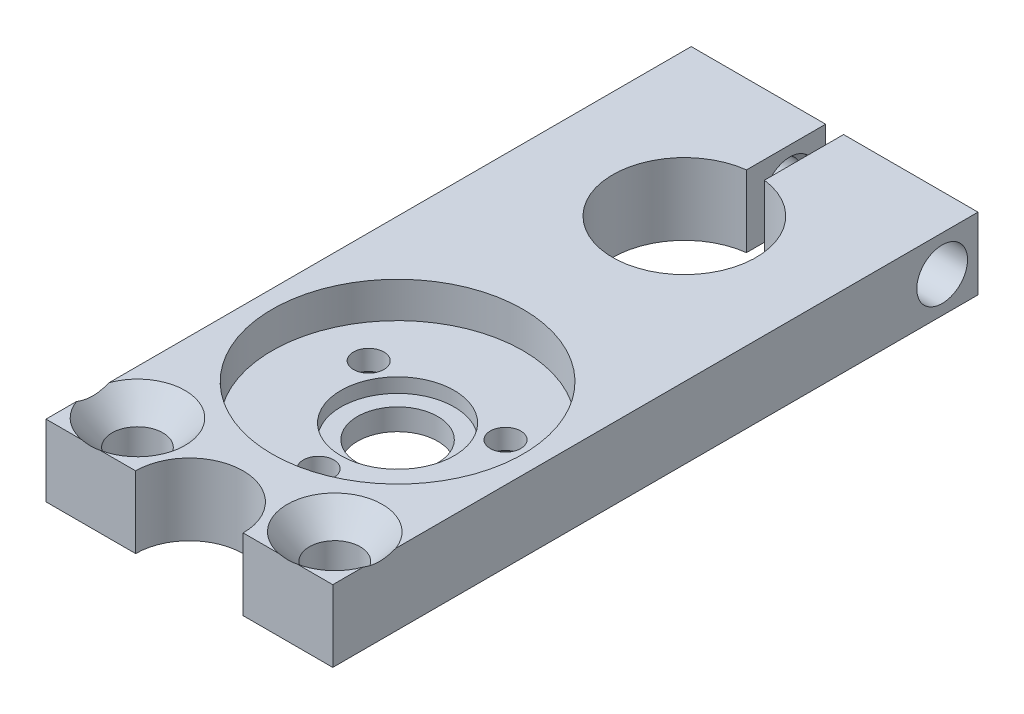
ISO-10303-21;
HEADER;
FILE_DESCRIPTION(('STEP AP214'),'2;1');
FILE_NAME('part.step','',(''),(''),'','','');
FILE_SCHEMA(('AUTOMOTIVE_DESIGN { 1 0 10303 214 1 1 1 1 }'));
ENDSEC;
DATA;
#1=APPLICATION_CONTEXT('core data for automotive mechanical design processes');
#2=APPLICATION_PROTOCOL_DEFINITION('international standard','automotive_design',2000,#1);
#3=PRODUCT_CONTEXT('',#1,'mechanical');
#4=PRODUCT('Part','Part','',(#3));
#5=PRODUCT_RELATED_PRODUCT_CATEGORY('part','',(#4));
#6=PRODUCT_DEFINITION_FORMATION('','',#4);
#7=PRODUCT_DEFINITION_CONTEXT('part definition',#1,'design');
#8=PRODUCT_DEFINITION('design','',#6,#7);
#9=PRODUCT_DEFINITION_SHAPE('','',#8);
#10=(LENGTH_UNIT() NAMED_UNIT(*) SI_UNIT(.MILLI.,.METRE.));
#11=(NAMED_UNIT(*) PLANE_ANGLE_UNIT() SI_UNIT($,.RADIAN.));
#12=(NAMED_UNIT(*) SI_UNIT($,.STERADIAN.) SOLID_ANGLE_UNIT());
#13=UNCERTAINTY_MEASURE_WITH_UNIT(LENGTH_MEASURE(1.E-05),#10,'distance_accuracy_value','');
#14=(GEOMETRIC_REPRESENTATION_CONTEXT(3) GLOBAL_UNCERTAINTY_ASSIGNED_CONTEXT((#13)) GLOBAL_UNIT_ASSIGNED_CONTEXT((#10,
#11,#12)) REPRESENTATION_CONTEXT('',''));
#15=CARTESIAN_POINT('',(0.,0.,0.));
#16=DIRECTION('',(0.,0.,1.));
#17=DIRECTION('',(1.,0.,0.));
#18=AXIS2_PLACEMENT_3D('',#15,#16,#17);
#19=CARTESIAN_POINT('',(12.7,3.17499999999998,0.));
#20=DIRECTION('',(0.,-1.,0.));
#21=DIRECTION('',(0.,0.,-1.));
#22=AXIS2_PLACEMENT_3D('',#19,#20,#21);
#23=PLANE('',#22);
#24=DIRECTION('',(-1.,0.,0.));
#25=VECTOR('',#24,1.);
#26=CARTESIAN_POINT('',(12.7,3.17499999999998,0.));
#27=LINE('',#26,#25);
#28=CARTESIAN_POINT('',(-9.53558052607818,3.17499999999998,0.));
#29=VERTEX_POINT('',#28);
#30=CARTESIAN_POINT('',(-12.7,3.17499999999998,0.));
#31=VERTEX_POINT('',#30);
#32=EDGE_CURVE('E165',#29,#31,#27,.T.);
#33=ORIENTED_EDGE('',*,*,#32,.F.);
#34=CARTESIAN_POINT('',(-8.7376,3.17499999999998,-4.1402));
#35=DIRECTION('',(0.,1.,0.));
#36=DIRECTION('',(0.,0.,1.));
#37=AXIS2_PLACEMENT_3D('',#34,#35,#36);
#38=CIRCLE('',#37,4.2164);
#39=CARTESIAN_POINT('',(-12.7,3.17499999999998,-2.69887588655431));
#40=VERTEX_POINT('',#39);
#41=EDGE_CURVE('E145',#40,#29,#38,.T.);
#42=ORIENTED_EDGE('',*,*,#41,.F.);
#43=DIRECTION('',(0.,0.,1.));
#44=VECTOR('',#43,1.);
#45=CARTESIAN_POINT('',(-12.7,3.17499999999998,0.));
#46=LINE('',#45,#44);
#47=EDGE_CURVE('E259',#40,#31,#46,.T.);
#48=ORIENTED_EDGE('',*,*,#47,.T.);
#49=EDGE_LOOP('',(#33,#42,#48));
#50=FACE_BOUND('',#49,.T.);
#51=ADVANCED_FACE('F38',(#50),#23,.F.);
#52=DIRECTION('',(0.,0.,1.));
#53=VECTOR('',#52,1.);
#54=CARTESIAN_POINT('',(12.7,3.17499999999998,0.));
#55=LINE('',#54,#53);
#56=CARTESIAN_POINT('',(12.7,3.17499999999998,-2.69887588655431));
#57=VERTEX_POINT('',#56);
#58=CARTESIAN_POINT('',(12.7,3.17499999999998,0.));
#59=VERTEX_POINT('',#58);
#60=EDGE_CURVE('E285',#57,#59,#55,.T.);
#61=ORIENTED_EDGE('',*,*,#60,.F.);
#62=CARTESIAN_POINT('',(8.7376,3.17499999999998,-4.1402));
#63=DIRECTION('',(0.,1.,0.));
#64=DIRECTION('',(0.,0.,1.));
#65=AXIS2_PLACEMENT_3D('',#62,#63,#64);
#66=CIRCLE('',#65,4.2164);
#67=CARTESIAN_POINT('',(9.53558052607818,3.17499999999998,0.));
#68=VERTEX_POINT('',#67);
#69=EDGE_CURVE('E66',#68,#57,#66,.T.);
#70=ORIENTED_EDGE('',*,*,#69,.F.);
#71=EDGE_CURVE('E167',#59,#68,#27,.T.);
#72=ORIENTED_EDGE('',*,*,#71,.F.);
#73=EDGE_LOOP('',(#61,#70,#72));
#74=FACE_BOUND('',#73,.T.);
#75=ADVANCED_FACE('F238',(#74),#23,.F.);
#76=CARTESIAN_POINT('',(-0.793750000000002,-3.17599999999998,-57.15));
#77=DIRECTION('',(-1.,0.,0.));
#78=DIRECTION('',(0.,0.,1.));
#79=AXIS2_PLACEMENT_3D('',#76,#77,#78);
#80=PLANE('',#79);
#81=CARTESIAN_POINT('',(-0.793750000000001,0.,-53.975));
#82=DIRECTION('',(-1.,0.,0.));
#83=DIRECTION('',(0.,0.,1.));
#84=AXIS2_PLACEMENT_3D('',#81,#82,#83);
#85=CIRCLE('',#84,2.24789999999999);
#86=CARTESIAN_POINT('',(-0.79375,0.,-51.7271));
#87=VERTEX_POINT('',#86);
#88=EDGE_CURVE('E212',#87,#87,#85,.T.);
#89=ORIENTED_EDGE('',*,*,#88,.T.);
#90=EDGE_LOOP('',(#89));
#91=FACE_BOUND('',#90,.T.);
#92=DIRECTION('',(0.,0.,-1.));
#93=VECTOR('',#92,1.);
#94=CARTESIAN_POINT('',(-0.793750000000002,-3.17499999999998,-57.15));
#95=LINE('',#94,#93);
#96=CARTESIAN_POINT('',(-0.793749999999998,-3.17499999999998,-50.1405953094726));
#97=VERTEX_POINT('',#96);
#98=CARTESIAN_POINT('',(-0.793750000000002,-3.17499999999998,-57.15));
#99=VERTEX_POINT('',#98);
#100=EDGE_CURVE('E328',#97,#99,#95,.T.);
#101=ORIENTED_EDGE('',*,*,#100,.T.);
#102=DIRECTION('',(0.,1.,0.));
#103=VECTOR('',#102,1.);
#104=CARTESIAN_POINT('',(-0.793750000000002,-3.17599999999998,-57.15));
#105=LINE('',#104,#103);
#106=CARTESIAN_POINT('',(-0.793750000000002,3.17500000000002,-57.15));
#107=VERTEX_POINT('',#106);
#108=EDGE_CURVE('E338',#99,#107,#105,.T.);
#109=ORIENTED_EDGE('',*,*,#108,.T.);
#110=DIRECTION('',(0.,0.,1.));
#111=VECTOR('',#110,1.);
#112=CARTESIAN_POINT('',(-0.793750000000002,3.17500000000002,-57.15));
#113=LINE('',#112,#111);
#114=CARTESIAN_POINT('',(-0.793749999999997,3.17500000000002,-50.1405953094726));
#115=VERTEX_POINT('',#114);
#116=EDGE_CURVE('E330',#107,#115,#113,.T.);
#117=ORIENTED_EDGE('',*,*,#116,.T.);
#118=DIRECTION('',(0.,1.,0.));
#119=VECTOR('',#118,1.);
#120=CARTESIAN_POINT('',(-0.793749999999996,-3.17599999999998,-50.1405953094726));
#121=LINE('',#120,#119);
#122=EDGE_CURVE('E337',#97,#115,#121,.T.);
#123=ORIENTED_EDGE('',*,*,#122,.F.);
#124=EDGE_LOOP('',(#101,#109,#117,#123));
#125=FACE_BOUND('',#124,.T.);
#126=ADVANCED_FACE('F255',(#91,#125),#80,.F.);
#127=CARTESIAN_POINT('',(12.7,3.17499999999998,0.));
#128=DIRECTION('',(0.,0.,-1.));
#129=DIRECTION('',(0.,1.,0.));
#130=AXIS2_PLACEMENT_3D('',#127,#128,#129);
#131=PLANE('',#130);
#132=CARTESIAN_POINT('',(-4.7625,3.17499999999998,0.));
#133=VERTEX_POINT('',#132);
#134=CARTESIAN_POINT('',(-7.93961947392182,3.17499999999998,0.));
#135=VERTEX_POINT('',#134);
#136=EDGE_CURVE('E156',#133,#135,#27,.T.);
#137=ORIENTED_EDGE('',*,*,#136,.T.);
#138=CARTESIAN_POINT('',(-15.8066704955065,7.74869599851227,0.));
#139=CARTESIAN_POINT('',(-15.6685968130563,7.61165201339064,0.));
#140=CARTESIAN_POINT('',(-15.5300227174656,7.47510839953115,0.));
#141=CARTESIAN_POINT('',(-15.2516721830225,7.20323484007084,0.));
#142=CARTESIAN_POINT('',(-15.1118956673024,7.06790497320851,0.));
#143=CARTESIAN_POINT('',(-14.8306494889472,6.79839533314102,0.));
#144=CARTESIAN_POINT('',(-14.6891767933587,6.66421872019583,0.));
#145=CARTESIAN_POINT('',(-14.4045924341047,6.39761888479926,0.));
#146=CARTESIAN_POINT('',(-14.2614808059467,6.26519562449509,0.));
#147=CARTESIAN_POINT('',(-13.9666768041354,5.99643528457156,0.));
#148=CARTESIAN_POINT('',(-13.8148926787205,5.86019862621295,0.));
#149=CARTESIAN_POINT('',(-13.5087565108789,5.5906436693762,0.));
#150=CARTESIAN_POINT('',(-13.3544045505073,5.45732527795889,0.));
#151=CARTESIAN_POINT('',(-13.0427054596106,5.19450644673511,0.));
#152=CARTESIAN_POINT('',(-12.885361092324,5.06500274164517,0.));
#153=CARTESIAN_POINT('',(-12.5668544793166,4.81079622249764,0.));
#154=CARTESIAN_POINT('',(-12.4056927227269,4.68609279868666,0.));
#155=CARTESIAN_POINT('',(-12.076928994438,4.44174023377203,0.));
#156=CARTESIAN_POINT('',(-11.9092773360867,4.32215749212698,0.));
#157=CARTESIAN_POINT('',(-11.5678943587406,4.09167374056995,0.));
#158=CARTESIAN_POINT('',(-11.3941594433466,3.98077799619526,0.));
#159=CARTESIAN_POINT('',(-11.0415061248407,3.77235519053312,0.));
#160=CARTESIAN_POINT('',(-10.8626721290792,3.67468692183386,0.));
#161=CARTESIAN_POINT('',(-10.496943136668,3.49603189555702,0.));
#162=CARTESIAN_POINT('',(-10.3100612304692,3.41501920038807,0.));
#163=CARTESIAN_POINT('',(-10.0294534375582,3.31285425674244,0.));
#164=CARTESIAN_POINT('',(-9.93896525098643,3.28276105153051,0.));
#165=CARTESIAN_POINT('',(-9.75606073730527,3.22827386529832,0.));
#166=CARTESIAN_POINT('',(-9.66364069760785,3.20389222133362,0.));
#167=CARTESIAN_POINT('',(-9.46472193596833,3.15876611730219,0.));
#168=CARTESIAN_POINT('',(-9.35800749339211,3.13895754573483,0.));
#169=CARTESIAN_POINT('',(-9.14323476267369,3.10857614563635,0.));
#170=CARTESIAN_POINT('',(-9.03517621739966,3.09800511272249,0.));
#171=CARTESIAN_POINT('',(-8.81864513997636,3.08663139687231,0.));
#172=CARTESIAN_POINT('',(-8.7101731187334,3.08581912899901,0.));
#173=CARTESIAN_POINT('',(-8.49360738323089,3.0939806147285,0.));
#174=CARTESIAN_POINT('',(-8.38551365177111,3.10295391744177,0.));
#175=CARTESIAN_POINT('',(-8.17468623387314,3.12970880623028,0.));
#176=CARTESIAN_POINT('',(-8.07190687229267,3.14713649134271,0.));
#177=CARTESIAN_POINT('',(-7.86800132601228,3.18989732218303,0.));
#178=CARTESIAN_POINT('',(-7.76687549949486,3.21523215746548,0.));
#179=CARTESIAN_POINT('',(-7.56651138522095,3.27294653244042,0.));
#180=CARTESIAN_POINT('',(-7.46727613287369,3.30533650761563,0.));
#181=CARTESIAN_POINT('',(-7.27101967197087,3.37618830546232,0.));
#182=CARTESIAN_POINT('',(-7.1739984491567,3.414650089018,0.));
#183=CARTESIAN_POINT('',(-6.94808737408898,3.51133742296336,0.));
#184=CARTESIAN_POINT('',(-6.82012680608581,3.5717287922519,0.));
#185=CARTESIAN_POINT('',(-6.56803474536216,3.70008038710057,0.));
#186=CARTESIAN_POINT('',(-6.44390508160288,3.76804415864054,0.));
#187=CARTESIAN_POINT('',(-6.19891594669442,3.91009152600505,0.));
#188=CARTESIAN_POINT('',(-6.0780629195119,3.98418616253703,0.));
#189=CARTESIAN_POINT('',(-5.83946276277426,4.13715210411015,0.));
#190=CARTESIAN_POINT('',(-5.7217151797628,4.21602270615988,0.));
#191=CARTESIAN_POINT('',(-5.48710698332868,4.37885626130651,0.));
#192=CARTESIAN_POINT('',(-5.37028802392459,4.46287897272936,0.));
#193=CARTESIAN_POINT('',(-5.13903224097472,4.634136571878,0.));
#194=CARTESIAN_POINT('',(-5.02459549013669,4.72137155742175,0.));
#195=CARTESIAN_POINT('',(-4.79790539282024,4.89836892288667,0.));
#196=CARTESIAN_POINT('',(-4.68564974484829,4.9881283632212,0.));
#197=CARTESIAN_POINT('',(-4.46291628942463,5.16981175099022,0.));
#198=CARTESIAN_POINT('',(-4.35243840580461,5.26173560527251,0.));
#199=CARTESIAN_POINT('',(-4.10770920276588,5.46880674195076,0.));
#200=CARTESIAN_POINT('',(-3.97385242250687,5.58441984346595,0.));
#201=CARTESIAN_POINT('',(-3.70809624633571,5.81787714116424,0.));
#202=CARTESIAN_POINT('',(-3.57619692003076,5.93572141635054,0.));
#203=CARTESIAN_POINT('',(-3.18294125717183,6.29202074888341,0.));
#204=CARTESIAN_POINT('',(-2.92406352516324,6.53321122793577,0.));
#205=CARTESIAN_POINT('',(-2.4110241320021,7.02079517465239,0.));
#206=CARTESIAN_POINT('',(-2.15686506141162,7.2671913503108,0.));
#207=CARTESIAN_POINT('',(-1.65220383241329,7.76370873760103,0.));
#208=CARTESIAN_POINT('',(-1.40170178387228,8.01383006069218,0.));
#209=CARTESIAN_POINT('',(-0.902902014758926,8.51749069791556,0.));
#210=CARTESIAN_POINT('',(-0.654611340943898,8.77103697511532,0.));
#211=CARTESIAN_POINT('',(-0.160257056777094,9.28029683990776,0.));
#212=CARTESIAN_POINT('',(0.0858065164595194,9.53601046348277,0.));
#213=CARTESIAN_POINT('',(0.576067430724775,10.0490532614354,0.));
#214=CARTESIAN_POINT('',(0.820265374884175,10.3063818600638,0.));
#215=CARTESIAN_POINT('',(1.3072137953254,10.8224055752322,0.));
#216=CARTESIAN_POINT('',(1.54996426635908,11.0811006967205,0.));
#217=CARTESIAN_POINT('',(2.21443772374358,11.7924679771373,0.));
#218=CARTESIAN_POINT('',(2.63495186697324,12.2462690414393,0.));
#219=CARTESIAN_POINT('',(3.47339459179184,13.1563318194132,0.));
#220=CARTESIAN_POINT('',(3.89132291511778,13.6125937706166,0.));
#221=CARTESIAN_POINT('',(4.72335370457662,14.5248901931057,0.));
#222=CARTESIAN_POINT('',(5.13746491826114,14.9809166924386,0.));
#223=CARTESIAN_POINT('',(5.96410240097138,15.8943103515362,0.));
#224=CARTESIAN_POINT('',(6.37662884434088,16.3516773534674,0.));
#225=CARTESIAN_POINT('',(6.78859656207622,16.8095442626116,0.));
#226=B_SPLINE_CURVE_WITH_KNOTS('',3,(#138,#139,#140,#141,#142,#143,#144,#145,#146,#147,#148,
#149,#150,#151,#152,#153,#154,#155,#156,#157,#158,#159,#160,#161,#162,#163,#164,#165,#166,#167,
#168,#169,#170,#171,#172,#173,#174,#175,#176,#177,#178,#179,#180,#181,#182,#183,#184,#185,#186,
#187,#188,#189,#190,#191,#192,#193,#194,#195,#196,#197,#198,#199,#200,#201,#202,#203,#204,#205,
#206,#207,#208,#209,#210,#211,#212,#213,#214,#215,#216,#217,#218,#219,#220,#221,#222,#223,#224,
#225),.UNSPECIFIED.,.F.,.F.,(4,2,2,2,2,2,2,2,2,2,2,2,2,2,2,2,2,2,2,2,2,2,2,2,2,2,2,2,2,2,2,2,2,
2,2,2,2,2,2,2,2,2,2,4),(0.,0.583619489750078,1.16727657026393,1.75220934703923,2.33712947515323,
2.94897355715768,3.56079812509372,4.17208279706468,4.7832895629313,5.40088058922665,
6.01884311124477,6.62957694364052,7.239352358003,7.52527834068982,7.81181634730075,
8.13705137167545,8.46234960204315,8.78732830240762,9.1122920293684,9.42469398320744,
9.7371627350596,10.0500968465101,10.363028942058,10.7871832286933,11.2115369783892,
11.6366722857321,12.0617451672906,12.4933707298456,12.9250094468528,13.3561648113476,
13.7873016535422,14.3178884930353,14.8484941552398,15.9098487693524,16.9717697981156,
18.033722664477,19.0983212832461,20.1629376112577,21.2271938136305,22.2914538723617,
24.1474841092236,26.0036968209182,27.8516740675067,29.6994418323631),.UNSPECIFIED.);
#227=EDGE_CURVE('E142',#135,#29,#226,.F.);
#228=ORIENTED_EDGE('',*,*,#227,.T.);
#229=ORIENTED_EDGE('',*,*,#32,.T.);
#230=DIRECTION('',(0.,-1.,0.));
#231=VECTOR('',#230,1.);
#232=CARTESIAN_POINT('',(-12.7,3.17499999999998,0.));
#233=LINE('',#232,#231);
#234=CARTESIAN_POINT('',(-12.7,-3.17499999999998,0.));
#235=VERTEX_POINT('',#234);
#236=EDGE_CURVE('E262',#31,#235,#233,.T.);
#237=ORIENTED_EDGE('',*,*,#236,.T.);
#238=DIRECTION('',(-1.,0.,0.));
#239=VECTOR('',#238,1.);
#240=CARTESIAN_POINT('',(12.7,-3.17499999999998,0.));
#241=LINE('',#240,#239);
#242=CARTESIAN_POINT('',(-4.7625,-3.17499999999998,0.));
#243=VERTEX_POINT('',#242);
#244=EDGE_CURVE('E187',#243,#235,#241,.T.);
#245=ORIENTED_EDGE('',*,*,#244,.F.);
#246=DIRECTION('',(0.,1.,0.));
#247=VECTOR('',#246,1.);
#248=CARTESIAN_POINT('',(-4.7625,-3.17600000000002,0.));
#249=LINE('',#248,#247);
#250=EDGE_CURVE('E163',#133,#243,#249,.F.);
#251=ORIENTED_EDGE('',*,*,#250,.F.);
#252=EDGE_LOOP('',(#137,#228,#229,#237,#245,#251));
#253=FACE_BOUND('',#252,.T.);
#254=ADVANCED_FACE('F161',(#253),#131,.F.);
#255=CARTESIAN_POINT('',(12.7,3.17500000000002,-57.15));
#256=DIRECTION('',(0.,0.,1.));
#257=DIRECTION('',(1.,0.,0.));
#258=AXIS2_PLACEMENT_3D('',#255,#256,#257);
#259=PLANE('',#258);
#260=DIRECTION('',(-1.,0.,0.));
#261=VECTOR('',#260,1.);
#262=CARTESIAN_POINT('',(12.7,3.17500000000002,-57.15));
#263=LINE('',#262,#261);
#264=CARTESIAN_POINT('',(-12.7,3.17500000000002,-57.15));
#265=VERTEX_POINT('',#264);
#266=EDGE_CURVE('E172',#107,#265,#263,.T.);
#267=ORIENTED_EDGE('',*,*,#266,.F.);
#268=ORIENTED_EDGE('',*,*,#108,.F.);
#269=DIRECTION('',(-1.,0.,0.));
#270=VECTOR('',#269,1.);
#271=CARTESIAN_POINT('',(12.7,-3.17499999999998,-57.15));
#272=LINE('',#271,#270);
#273=CARTESIAN_POINT('',(-12.7,-3.17499999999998,-57.15));
#274=VERTEX_POINT('',#273);
#275=EDGE_CURVE('E182',#99,#274,#272,.T.);
#276=ORIENTED_EDGE('',*,*,#275,.T.);
#277=DIRECTION('',(0.,1.,0.));
#278=VECTOR('',#277,1.);
#279=CARTESIAN_POINT('',(-12.7,3.17500000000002,-57.15));
#280=LINE('',#279,#278);
#281=EDGE_CURVE('E269',#274,#265,#280,.T.);
#282=ORIENTED_EDGE('',*,*,#281,.T.);
#283=EDGE_LOOP('',(#267,#268,#276,#282));
#284=FACE_BOUND('',#283,.T.);
#285=ADVANCED_FACE('F242',(#284),#259,.F.);
#286=ORIENTED_EDGE('',*,*,#71,.T.);
#287=CARTESIAN_POINT('',(1.60909571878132,7.80775586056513,0.));
#288=CARTESIAN_POINT('',(1.74865218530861,7.66894548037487,0.));
#289=CARTESIAN_POINT('',(1.88871022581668,7.53063558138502,0.));
#290=CARTESIAN_POINT('',(2.17003284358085,7.25523087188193,0.));
#291=CARTESIAN_POINT('',(2.31129749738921,7.11813613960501,0.));
#292=CARTESIAN_POINT('',(2.59552946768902,6.84509539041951,0.));
#293=CARTESIAN_POINT('',(2.73849983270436,6.70915254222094,0.));
#294=CARTESIAN_POINT('',(3.02608837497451,6.43902509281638,0.));
#295=CARTESIAN_POINT('',(3.17070651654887,6.30484045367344,0.));
#296=CARTESIAN_POINT('',(3.46866459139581,6.03243088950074,0.));
#297=CARTESIAN_POINT('',(3.62209770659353,5.89430766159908,0.));
#298=CARTESIAN_POINT('',(3.93155467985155,5.62099654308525,0.));
#299=CARTESIAN_POINT('',(4.08757845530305,5.48580855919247,0.));
#300=CARTESIAN_POINT('',(4.4026524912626,5.21928002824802,0.));
#301=CARTESIAN_POINT('',(4.56169994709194,5.0879361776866,0.));
#302=CARTESIAN_POINT('',(4.88366130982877,4.83009389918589,0.));
#303=CARTESIAN_POINT('',(5.04657471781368,4.70359485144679,0.));
#304=CARTESIAN_POINT('',(5.37813439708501,4.45630136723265,0.));
#305=CARTESIAN_POINT('',(5.54680774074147,4.3355429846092,0.));
#306=CARTESIAN_POINT('',(5.89028016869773,4.10273583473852,0.));
#307=CARTESIAN_POINT('',(6.06508292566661,3.99069242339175,0.));
#308=CARTESIAN_POINT('',(6.41991759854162,3.78005750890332,0.));
#309=CARTESIAN_POINT('',(6.5998638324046,3.68132329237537,0.));
#310=CARTESIAN_POINT('',(6.96791726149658,3.50066148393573,0.));
#311=CARTESIAN_POINT('',(7.15601106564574,3.41870749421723,0.));
#312=CARTESIAN_POINT('',(7.43751068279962,3.3156944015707,0.));
#313=CARTESIAN_POINT('',(7.52760858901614,3.28554625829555,0.));
#314=CARTESIAN_POINT('',(7.70972572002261,3.23088259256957,0.));
#315=CARTESIAN_POINT('',(7.80174866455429,3.20637933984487,0.));
#316=CARTESIAN_POINT('',(8.00025776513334,3.16081609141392,0.));
#317=CARTESIAN_POINT('',(8.106967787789,3.14071598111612,0.));
#318=CARTESIAN_POINT('',(8.32175533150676,3.1097367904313,0.));
#319=CARTESIAN_POINT('',(8.42983311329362,3.09885949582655,0.));
#320=CARTESIAN_POINT('',(8.64642731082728,3.08687323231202,0.));
#321=CARTESIAN_POINT('',(8.75494317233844,3.08575439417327,0.));
#322=CARTESIAN_POINT('',(8.97162345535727,3.09331750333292,0.));
#323=CARTESIAN_POINT('',(9.07978789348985,3.10199898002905,0.));
#324=CARTESIAN_POINT('',(9.29081912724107,3.12821439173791,0.));
#325=CARTESIAN_POINT('',(9.39373030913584,3.14539702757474,0.));
#326=CARTESIAN_POINT('',(9.59791105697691,3.18770697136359,0.));
#327=CARTESIAN_POINT('',(9.69918026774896,3.21283597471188,0.));
#328=CARTESIAN_POINT('',(9.89983748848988,3.27017914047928,0.));
#329=CARTESIAN_POINT('',(9.99922243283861,3.30240392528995,0.));
#330=CARTESIAN_POINT('',(10.1957772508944,3.37296323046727,0.));
#331=CARTESIAN_POINT('',(10.292947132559,3.41129772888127,0.));
#332=CARTESIAN_POINT('',(10.5182523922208,3.50731950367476,0.));
#333=CARTESIAN_POINT('',(10.6454860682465,3.56711695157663,0.));
#334=CARTESIAN_POINT('',(10.8961648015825,3.69423120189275,0.));
#335=CARTESIAN_POINT('',(11.0196080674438,3.76155149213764,0.));
#336=CARTESIAN_POINT('',(11.2632523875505,3.90227904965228,0.));
#337=CARTESIAN_POINT('',(11.3834471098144,3.97569720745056,0.));
#338=CARTESIAN_POINT('',(11.6207541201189,4.12729166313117,0.));
#339=CARTESIAN_POINT('',(11.7378668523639,4.20546726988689,0.));
#340=CARTESIAN_POINT('',(11.9712133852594,4.36688943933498,0.));
#341=CARTESIAN_POINT('',(12.0874057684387,4.45019561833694,0.));
#342=CARTESIAN_POINT('',(12.3174206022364,4.6200134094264,0.));
#343=CARTESIAN_POINT('',(12.4312429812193,4.7065251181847,0.));
#344=CARTESIAN_POINT('',(12.6567148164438,4.88207391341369,0.));
#345=CARTESIAN_POINT('',(12.7683665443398,4.97110809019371,0.));
#346=CARTESIAN_POINT('',(12.9898981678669,5.15133916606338,0.));
#347=CARTESIAN_POINT('',(13.0997781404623,5.24253597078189,0.));
#348=CARTESIAN_POINT('',(13.3441409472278,5.44879705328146,0.));
#349=CARTESIAN_POINT('',(13.4782136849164,5.56434670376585,0.));
#350=CARTESIAN_POINT('',(13.7443801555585,5.79770621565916,0.));
#351=CARTESIAN_POINT('',(13.87647381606,5.91551615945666,0.));
#352=CARTESIAN_POINT('',(14.2702873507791,6.27174652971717,0.));
#353=CARTESIAN_POINT('',(14.5295024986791,6.5129356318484,0.));
#354=CARTESIAN_POINT('',(15.0431735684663,7.00057383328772,0.));
#355=CARTESIAN_POINT('',(15.2976268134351,7.24702573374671,0.));
#356=CARTESIAN_POINT('',(15.8028444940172,7.74369021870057,0.));
#357=CARTESIAN_POINT('',(16.0536088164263,7.9939029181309,0.));
#358=CARTESIAN_POINT('',(16.5529210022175,8.49778046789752,0.));
#359=CARTESIAN_POINT('',(16.8014616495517,8.75145245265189,0.));
#360=CARTESIAN_POINT('',(17.2962994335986,9.26098086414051,0.));
#361=CARTESIAN_POINT('',(17.5425965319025,9.51683732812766,0.));
#362=CARTESIAN_POINT('',(18.0333102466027,10.0301759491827,0.));
#363=CARTESIAN_POINT('',(18.2777274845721,10.2876575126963,0.));
#364=CARTESIAN_POINT('',(18.765105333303,10.8039961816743,0.));
#365=CARTESIAN_POINT('',(19.0080659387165,11.0628532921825,0.));
#366=CARTESIAN_POINT('',(19.6725550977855,11.7740842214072,0.));
#367=CARTESIAN_POINT('',(20.0928724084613,12.227589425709,0.));
#368=CARTESIAN_POINT('',(20.9309145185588,13.1370691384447,0.));
#369=CARTESIAN_POINT('',(21.3486390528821,13.5930438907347,0.));
#370=CARTESIAN_POINT('',(22.180227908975,14.5047398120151,0.));
#371=CARTESIAN_POINT('',(22.5941011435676,14.9604528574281,0.));
#372=CARTESIAN_POINT('',(23.4202578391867,15.8732221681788,0.));
#373=CARTESIAN_POINT('',(23.8325414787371,16.3302782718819,0.));
#374=CARTESIAN_POINT('',(24.2442651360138,16.7878354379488,0.));
#375=B_SPLINE_CURVE_WITH_KNOTS('',3,(#287,#288,#289,#290,#291,#292,#293,#294,#295,#296,#297,
#298,#299,#300,#301,#302,#303,#304,#305,#306,#307,#308,#309,#310,#311,#312,#313,#314,#315,#316,
#317,#318,#319,#320,#321,#322,#323,#324,#325,#326,#327,#328,#329,#330,#331,#332,#333,#334,#335,
#336,#337,#338,#339,#340,#341,#342,#343,#344,#345,#346,#347,#348,#349,#350,#351,#352,#353,#354,
#355,#356,#357,#358,#359,#360,#361,#362,#363,#364,#365,#366,#367,#368,#369,#370,#371,#372,#373,
#374),.UNSPECIFIED.,.F.,.F.,(4,2,2,2,2,2,2,2,2,2,2,2,2,2,2,2,2,2,2,2,2,2,2,2,2,2,2,2,2,2,2,2,2,
2,2,2,2,2,2,2,2,2,2,4),(0.,0.590510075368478,1.1810578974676,1.77289750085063,2.36472431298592,
2.98403103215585,3.60331804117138,4.22205622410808,4.8407149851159,5.46285048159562,
6.08536534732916,6.70055861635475,7.31477652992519,7.59964692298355,7.88513078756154,
8.21051491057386,8.53596202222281,8.86107995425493,9.18618227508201,9.49884973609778,
9.81158395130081,10.1247895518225,10.4379940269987,10.8594200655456,11.2810423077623,
11.7034344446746,12.1257653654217,12.5546102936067,12.983468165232,13.411850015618,
13.8402132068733,14.3711653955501,14.9021369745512,15.964227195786,17.0268975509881,
18.0896004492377,19.154992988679,20.2204037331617,21.2854455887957,22.3504913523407,
24.2054690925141,26.0606334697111,27.9074345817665,29.7540218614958),.UNSPECIFIED.);
#376=CARTESIAN_POINT('',(7.93961947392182,3.17499999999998,0.));
#377=VERTEX_POINT('',#376);
#378=EDGE_CURVE('E298',#68,#377,#375,.F.);
#379=ORIENTED_EDGE('',*,*,#378,.T.);
#380=CARTESIAN_POINT('',(4.7625,3.17499999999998,0.));
#381=VERTEX_POINT('',#380);
#382=EDGE_CURVE('E164',#377,#381,#27,.T.);
#383=ORIENTED_EDGE('',*,*,#382,.T.);
#384=DIRECTION('',(0.,1.,0.));
#385=VECTOR('',#384,1.);
#386=CARTESIAN_POINT('',(4.7625,-3.17600000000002,0.));
#387=LINE('',#386,#385);
#388=CARTESIAN_POINT('',(4.7625,-3.17499999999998,0.));
#389=VERTEX_POINT('',#388);
#390=EDGE_CURVE('E317',#389,#381,#387,.T.);
#391=ORIENTED_EDGE('',*,*,#390,.F.);
#392=CARTESIAN_POINT('',(12.7,-3.17499999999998,0.));
#393=VERTEX_POINT('',#392);
#394=EDGE_CURVE('E188',#393,#389,#241,.T.);
#395=ORIENTED_EDGE('',*,*,#394,.F.);
#396=DIRECTION('',(0.,-1.,0.));
#397=VECTOR('',#396,1.);
#398=CARTESIAN_POINT('',(12.7,3.17499999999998,0.));
#399=LINE('',#398,#397);
#400=EDGE_CURVE('E277',#59,#393,#399,.T.);
#401=ORIENTED_EDGE('',*,*,#400,.F.);
#402=EDGE_LOOP('',(#286,#379,#383,#391,#395,#401));
#403=FACE_BOUND('',#402,.T.);
#404=ADVANCED_FACE('F40',(#403),#131,.F.);
#405=CARTESIAN_POINT('',(12.7,-3.17499999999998,0.));
#406=DIRECTION('',(0.,1.,0.));
#407=DIRECTION('',(0.,0.,1.));
#408=AXIS2_PLACEMENT_3D('',#405,#406,#407);
#409=PLANE('',#408);
#410=CARTESIAN_POINT('',(-8.7376,-3.17500000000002,-4.1402));
#411=DIRECTION('',(0.,1.,0.));
#412=DIRECTION('',(0.,0.,1.));
#413=AXIS2_PLACEMENT_3D('',#410,#411,#412);
#414=CIRCLE('',#413,2.2479);
#415=CARTESIAN_POINT('',(-8.7376,-3.17500000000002,-1.8923));
#416=VERTEX_POINT('',#415);
#417=EDGE_CURVE('E704',#416,#416,#414,.T.);
#418=ORIENTED_EDGE('',*,*,#417,.T.);
#419=EDGE_LOOP('',(#418));
#420=FACE_BOUND('',#419,.T.);
#421=CARTESIAN_POINT('',(8.7376,-3.17500000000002,-4.1402));
#422=DIRECTION('',(0.,1.,0.));
#423=DIRECTION('',(0.,0.,1.));
#424=AXIS2_PLACEMENT_3D('',#421,#422,#423);
#425=CIRCLE('',#424,2.2479);
#426=CARTESIAN_POINT('',(8.7376,-3.17500000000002,-1.8923));
#427=VERTEX_POINT('',#426);
#428=EDGE_CURVE('E149',#427,#427,#425,.T.);
#429=ORIENTED_EDGE('',*,*,#428,.T.);
#430=EDGE_LOOP('',(#429));
#431=FACE_BOUND('',#430,.T.);
#432=ORIENTED_EDGE('',*,*,#394,.T.);
#433=CARTESIAN_POINT('',(0.,-3.17499999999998,0.));
#434=DIRECTION('',(0.,1.,0.));
#435=DIRECTION('',(0.,0.,1.));
#436=AXIS2_PLACEMENT_3D('',#433,#434,#435);
#437=CIRCLE('',#436,4.7625);
#438=EDGE_CURVE('E323',#243,#389,#437,.F.);
#439=ORIENTED_EDGE('',*,*,#438,.F.);
#440=ORIENTED_EDGE('',*,*,#244,.T.);
#441=DIRECTION('',(0.,0.,-1.));
#442=VECTOR('',#441,1.);
#443=CARTESIAN_POINT('',(-12.7,-3.17499999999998,0.));
#444=LINE('',#443,#442);
#445=EDGE_CURVE('E265',#235,#274,#444,.T.);
#446=ORIENTED_EDGE('',*,*,#445,.T.);
#447=ORIENTED_EDGE('',*,*,#275,.F.);
#448=ORIENTED_EDGE('',*,*,#100,.F.);
#449=CARTESIAN_POINT('',(0.,-3.17499999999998,-43.8404));
#450=DIRECTION('',(0.,1.,0.));
#451=DIRECTION('',(0.,0.,1.));
#452=AXIS2_PLACEMENT_3D('',#449,#450,#451);
#453=CIRCLE('',#452,6.35);
#454=CARTESIAN_POINT('',(0.793749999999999,-3.17499999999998,-50.1405953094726));
#455=VERTEX_POINT('',#454);
#456=EDGE_CURVE('E340',#455,#97,#453,.F.);
#457=ORIENTED_EDGE('',*,*,#456,.F.);
#458=DIRECTION('',(0.,0.,1.));
#459=VECTOR('',#458,1.);
#460=CARTESIAN_POINT('',(0.793749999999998,-3.17499999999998,-57.15));
#461=LINE('',#460,#459);
#462=CARTESIAN_POINT('',(0.793749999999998,-3.17499999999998,-57.15));
#463=VERTEX_POINT('',#462);
#464=EDGE_CURVE('E325',#463,#455,#461,.T.);
#465=ORIENTED_EDGE('',*,*,#464,.F.);
#466=CARTESIAN_POINT('',(12.7,-3.17499999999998,-57.15));
#467=VERTEX_POINT('',#466);
#468=EDGE_CURVE('E184',#467,#463,#272,.T.);
#469=ORIENTED_EDGE('',*,*,#468,.F.);
#470=DIRECTION('',(0.,0.,-1.));
#471=VECTOR('',#470,1.);
#472=CARTESIAN_POINT('',(12.7,-3.17499999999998,0.));
#473=LINE('',#472,#471);
#474=EDGE_CURVE('E279',#393,#467,#473,.T.);
#475=ORIENTED_EDGE('',*,*,#474,.F.);
#476=EDGE_LOOP('',(#432,#439,#440,#446,#447,#448,#457,#465,#469,#475));
#477=FACE_BOUND('',#476,.T.);
#478=CARTESIAN_POINT('',(6.06018596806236,-3.17499999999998,-21.93925));
#479=DIRECTION('',(0.,-1.,0.));
#480=DIRECTION('',(0.,0.,-1.));
#481=AXIS2_PLACEMENT_3D('',#478,#479,#480);
#482=CIRCLE('',#481,2.75);
#483=CARTESIAN_POINT('',(6.06018596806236,-3.17499999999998,-24.68925));
#484=VERTEX_POINT('',#483);
#485=EDGE_CURVE('E205',#484,#484,#482,.T.);
#486=ORIENTED_EDGE('',*,*,#485,.F.);
#487=EDGE_LOOP('',(#486));
#488=FACE_BOUND('',#487,.T.);
#489=CARTESIAN_POINT('',(-6.0601859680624,-3.17499999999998,-21.9392499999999));
#490=DIRECTION('',(0.,-1.,0.));
#491=DIRECTION('',(0.,0.,-1.));
#492=AXIS2_PLACEMENT_3D('',#489,#490,#491);
#493=CIRCLE('',#492,2.75);
#494=CARTESIAN_POINT('',(-6.0601859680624,-3.17499999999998,-24.6892499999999));
#495=VERTEX_POINT('',#494);
#496=EDGE_CURVE('E200',#495,#495,#493,.T.);
#497=ORIENTED_EDGE('',*,*,#496,.F.);
#498=EDGE_LOOP('',(#497));
#499=FACE_BOUND('',#498,.T.);
#500=CARTESIAN_POINT('',(0.,-3.17499999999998,-11.4427));
#501=DIRECTION('',(0.,-1.,0.));
#502=DIRECTION('',(0.,0.,-1.));
#503=AXIS2_PLACEMENT_3D('',#500,#501,#502);
#504=CIRCLE('',#503,2.75);
#505=CARTESIAN_POINT('',(0.,-3.17499999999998,-14.1927));
#506=VERTEX_POINT('',#505);
#507=EDGE_CURVE('E195',#506,#506,#504,.T.);
#508=ORIENTED_EDGE('',*,*,#507,.F.);
#509=EDGE_LOOP('',(#508));
#510=FACE_BOUND('',#509,.T.);
#511=CARTESIAN_POINT('',(0.,-3.17499999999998,-18.4404));
#512=DIRECTION('',(0.,1.,0.));
#513=DIRECTION('',(0.,0.,1.));
#514=AXIS2_PLACEMENT_3D('',#511,#512,#513);
#515=CIRCLE('',#514,3.556);
#516=CARTESIAN_POINT('',(0.,-3.17499999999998,-14.8844));
#517=VERTEX_POINT('',#516);
#518=EDGE_CURVE('E365',#517,#517,#515,.F.);
#519=ORIENTED_EDGE('',*,*,#518,.F.);
#520=EDGE_LOOP('',(#519));
#521=FACE_BOUND('',#520,.T.);
#522=ADVANCED_FACE('F240',(#420,#431,#477,#488,#499,#510,#521),#409,.F.);
#523=ORIENTED_EDGE('',*,*,#468,.T.);
#524=DIRECTION('',(0.,1.,0.));
#525=VECTOR('',#524,1.);
#526=CARTESIAN_POINT('',(0.793749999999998,-3.17599999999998,-57.15));
#527=LINE('',#526,#525);
#528=CARTESIAN_POINT('',(0.793749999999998,3.17500000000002,-57.15));
#529=VERTEX_POINT('',#528);
#530=EDGE_CURVE('E341',#463,#529,#527,.T.);
#531=ORIENTED_EDGE('',*,*,#530,.T.);
#532=CARTESIAN_POINT('',(12.7,3.17500000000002,-57.15));
#533=VERTEX_POINT('',#532);
#534=EDGE_CURVE('E177',#533,#529,#263,.T.);
#535=ORIENTED_EDGE('',*,*,#534,.F.);
#536=DIRECTION('',(0.,1.,0.));
#537=VECTOR('',#536,1.);
#538=CARTESIAN_POINT('',(12.7,3.17500000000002,-57.15));
#539=LINE('',#538,#537);
#540=EDGE_CURVE('E282',#467,#533,#539,.T.);
#541=ORIENTED_EDGE('',*,*,#540,.F.);
#542=EDGE_LOOP('',(#523,#531,#535,#541));
#543=FACE_BOUND('',#542,.T.);
#544=ADVANCED_FACE('F236',(#543),#259,.F.);
#545=CARTESIAN_POINT('',(0.,3.17499999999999,-18.4404));
#546=DIRECTION('',(0.,1.,0.));
#547=DIRECTION('',(0.,0.,1.));
#548=AXIS2_PLACEMENT_3D('',#545,#546,#547);
#549=CIRCLE('',#548,11.1125);
#550=CARTESIAN_POINT('',(0.,3.17499999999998,-7.3279));
#551=VERTEX_POINT('',#550);
#552=EDGE_CURVE('E272',#551,#551,#549,.T.);
#553=ORIENTED_EDGE('',*,*,#552,.F.);
#554=EDGE_LOOP('',(#553));
#555=FACE_BOUND('',#554,.T.);
#556=CARTESIAN_POINT('',(-12.7,3.17499999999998,-5.58152411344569));
#557=VERTEX_POINT('',#556);
#558=EDGE_CURVE('E158',#265,#557,#46,.T.);
#559=ORIENTED_EDGE('',*,*,#558,.T.);
#560=EDGE_CURVE('E59',#135,#557,#38,.T.);
#561=ORIENTED_EDGE('',*,*,#560,.F.);
#562=ORIENTED_EDGE('',*,*,#136,.F.);
#563=CARTESIAN_POINT('',(0.,3.17499999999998,0.));
#564=DIRECTION('',(0.,1.,0.));
#565=DIRECTION('',(0.,0.,1.));
#566=AXIS2_PLACEMENT_3D('',#563,#564,#565);
#567=CIRCLE('',#566,4.7625);
#568=EDGE_CURVE('E321',#381,#133,#567,.T.);
#569=ORIENTED_EDGE('',*,*,#568,.F.);
#570=ORIENTED_EDGE('',*,*,#382,.F.);
#571=CARTESIAN_POINT('',(12.7,3.17499999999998,-5.58152411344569));
#572=VERTEX_POINT('',#571);
#573=EDGE_CURVE('E295',#572,#377,#66,.T.);
#574=ORIENTED_EDGE('',*,*,#573,.F.);
#575=EDGE_CURVE('E168',#533,#572,#55,.T.);
#576=ORIENTED_EDGE('',*,*,#575,.F.);
#577=ORIENTED_EDGE('',*,*,#534,.T.);
#578=DIRECTION('',(0.,0.,-1.));
#579=VECTOR('',#578,1.);
#580=CARTESIAN_POINT('',(0.793749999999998,3.17500000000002,-57.15));
#581=LINE('',#580,#579);
#582=CARTESIAN_POINT('',(0.793749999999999,3.17500000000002,-50.1405953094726));
#583=VERTEX_POINT('',#582);
#584=EDGE_CURVE('E335',#583,#529,#581,.T.);
#585=ORIENTED_EDGE('',*,*,#584,.F.);
#586=CARTESIAN_POINT('',(0.,3.17500000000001,-43.8404));
#587=DIRECTION('',(0.,1.,0.));
#588=DIRECTION('',(0.,0.,1.));
#589=AXIS2_PLACEMENT_3D('',#586,#587,#588);
#590=CIRCLE('',#589,6.35);
#591=EDGE_CURVE('E332',#115,#583,#590,.T.);
#592=ORIENTED_EDGE('',*,*,#591,.F.);
#593=ORIENTED_EDGE('',*,*,#116,.F.);
#594=ORIENTED_EDGE('',*,*,#266,.T.);
#595=EDGE_LOOP('',(#559,#561,#562,#569,#570,#574,#576,#577,#585,#592,#593,#594));
#596=FACE_BOUND('',#595,.T.);
#597=ADVANCED_FACE('F154',(#555,#596),#23,.F.);
#598=CARTESIAN_POINT('',(12.7,-3.17499999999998,0.));
#599=DIRECTION('',(1.,0.,0.));
#600=DIRECTION('',(0.,0.,-1.));
#601=AXIS2_PLACEMENT_3D('',#598,#599,#600);
#602=PLANE('',#601);
#603=CARTESIAN_POINT('',(12.7,8.38807789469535,-11.9394262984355));
#604=CARTESIAN_POINT('',(12.7,8.22502496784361,-11.7804257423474));
#605=CARTESIAN_POINT('',(12.7,8.06245244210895,-11.6209290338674));
#606=CARTESIAN_POINT('',(12.7,7.73849242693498,-11.3007187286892));
#607=CARTESIAN_POINT('',(12.7,7.57710500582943,-11.1400050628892));
#608=CARTESIAN_POINT('',(12.7,7.25539900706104,-10.8167935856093));
#609=CARTESIAN_POINT('',(12.7,7.09508362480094,-10.6542925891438));
#610=CARTESIAN_POINT('',(12.7,6.77621407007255,-10.3275765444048));
#611=CARTESIAN_POINT('',(12.7,6.61765985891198,-10.1633615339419));
#612=CARTESIAN_POINT('',(12.7,6.29426184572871,-9.82396375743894));
#613=CARTESIAN_POINT('',(12.7,6.12953836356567,-9.6486660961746));
#614=CARTESIAN_POINT('',(12.7,5.80318888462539,-9.29521274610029));
#615=CARTESIAN_POINT('',(12.7,5.64156279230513,-9.11705714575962));
#616=CARTESIAN_POINT('',(12.7,5.32250553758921,-8.75732114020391));
#617=CARTESIAN_POINT('',(12.7,5.16507049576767,-8.57574418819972));
#618=CARTESIAN_POINT('',(12.7,4.85562307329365,-8.20804357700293));
#619=CARTESIAN_POINT('',(12.7,4.7036099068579,-8.02192058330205));
#620=CARTESIAN_POINT('',(12.7,4.41773655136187,-7.65742017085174));
#621=CARTESIAN_POINT('',(12.7,4.28335778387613,-7.47945196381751));
#622=CARTESIAN_POINT('',(12.7,4.02341376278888,-7.11690856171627));
#623=CARTESIAN_POINT('',(12.7,3.89785526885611,-6.93232845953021));
#624=CARTESIAN_POINT('',(12.7,3.66103487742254,-6.55744633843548));
#625=CARTESIAN_POINT('',(12.7,3.54960966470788,-6.36724864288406));
#626=CARTESIAN_POINT('',(12.7,3.34498049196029,-5.97738963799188));
#627=CARTESIAN_POINT('',(12.7,3.25174273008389,-5.77774675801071));
#628=CARTESIAN_POINT('',(12.7,3.141405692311,-5.49566056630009));
#629=CARTESIAN_POINT('',(12.7,3.11303256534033,-5.41759753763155));
#630=CARTESIAN_POINT('',(12.7,3.06049177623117,-5.25985852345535));
#631=CARTESIAN_POINT('',(12.7,3.0363339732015,-5.18017923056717));
#632=CARTESIAN_POINT('',(12.7,2.9872378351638,-4.99885210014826));
#633=CARTESIAN_POINT('',(12.7,2.96369391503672,-4.89682012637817));
#634=CARTESIAN_POINT('',(12.7,2.92517216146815,-4.69111328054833));
#635=CARTESIAN_POINT('',(12.7,2.91019599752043,-4.58743809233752));
#636=CARTESIAN_POINT('',(12.7,2.88954223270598,-4.37929588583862));
#637=CARTESIAN_POINT('',(12.7,2.88385187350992,-4.27483015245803));
#638=CARTESIAN_POINT('',(12.7,2.88202446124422,-4.06582196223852));
#639=CARTESIAN_POINT('',(12.7,2.88588662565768,-3.96127951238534));
#640=CARTESIAN_POINT('',(12.7,2.90272398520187,-3.75585571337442));
#641=CARTESIAN_POINT('',(12.7,2.91544414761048,-3.65495308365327));
#642=CARTESIAN_POINT('',(12.7,2.94914196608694,-3.45453243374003));
#643=CARTESIAN_POINT('',(12.7,2.9701213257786,-3.35501470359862));
#644=CARTESIAN_POINT('',(12.7,3.01953500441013,-3.15768408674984));
#645=CARTESIAN_POINT('',(12.7,3.04798208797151,-3.05987442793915));
#646=CARTESIAN_POINT('',(12.7,3.11135970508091,-2.86640548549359));
#647=CARTESIAN_POINT('',(12.7,3.14629046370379,-2.7707462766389));
#648=CARTESIAN_POINT('',(12.7,3.27452143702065,-2.44906228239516));
#649=CARTESIAN_POINT('',(12.7,3.38100809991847,-2.228249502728));
#650=CARTESIAN_POINT('',(12.7,3.55645312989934,-1.90579567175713));
#651=CARTESIAN_POINT('',(12.7,3.61763209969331,-1.79965688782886));
#652=CARTESIAN_POINT('',(12.7,3.74430651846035,-1.58998182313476));
#653=CARTESIAN_POINT('',(12.7,3.80980125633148,-1.48644511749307));
#654=CARTESIAN_POINT('',(12.7,3.94531567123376,-1.28014675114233));
#655=CARTESIAN_POINT('',(12.7,4.0153888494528,-1.17742056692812));
#656=CARTESIAN_POINT('',(12.7,4.1585071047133,-0.97406022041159));
#657=CARTESIAN_POINT('',(12.7,4.231552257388,-0.873426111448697));
#658=CARTESIAN_POINT('',(12.7,4.38002500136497,-0.674089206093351));
#659=CARTESIAN_POINT('',(12.7,4.45545020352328,-0.575384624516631));
#660=CARTESIAN_POINT('',(12.7,4.60834637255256,-0.379583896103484));
#661=CARTESIAN_POINT('',(12.7,4.68581725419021,-0.282487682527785));
#662=CARTESIAN_POINT('',(12.7,4.94523944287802,0.036790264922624));
#663=CARTESIAN_POINT('',(12.7,5.13091462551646,0.255947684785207));
#664=CARTESIAN_POINT('',(12.7,5.50859889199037,0.688752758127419));
#665=CARTESIAN_POINT('',(12.7,5.7006091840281,0.902399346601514));
#666=CARTESIAN_POINT('',(12.7,6.08930911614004,1.32560419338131));
#667=CARTESIAN_POINT('',(12.7,6.28600134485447,1.53516006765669));
#668=CARTESIAN_POINT('',(12.7,6.6827958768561,1.95102041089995));
#669=CARTESIAN_POINT('',(12.7,6.88289829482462,2.1573247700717));
#670=CARTESIAN_POINT('',(12.7,7.2862477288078,2.56791969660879));
#671=CARTESIAN_POINT('',(12.7,7.48950173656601,2.77220338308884));
#672=CARTESIAN_POINT('',(12.7,7.89806424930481,3.17870882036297));
#673=CARTESIAN_POINT('',(12.7,8.10337278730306,3.38093053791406));
#674=CARTESIAN_POINT('',(12.7,8.72157985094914,3.9849631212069));
#675=CARTESIAN_POINT('',(12.7,9.13690573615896,4.38428864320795));
#676=CARTESIAN_POINT('',(12.7,9.92031180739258,5.12941301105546));
#677=CARTESIAN_POINT('',(12.7,10.2878964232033,5.47573524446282));
#678=CARTESIAN_POINT('',(12.7,11.0255292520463,6.16582074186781));
#679=CARTESIAN_POINT('',(12.7,11.3955777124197,6.50958374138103));
#680=CARTESIAN_POINT('',(12.7,12.1356278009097,7.19342000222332));
#681=CARTESIAN_POINT('',(12.7,12.5056203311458,7.53350312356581));
#682=CARTESIAN_POINT('',(12.7,13.2469745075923,8.21208271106));
#683=CARTESIAN_POINT('',(12.7,13.6183359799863,8.55057936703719));
#684=CARTESIAN_POINT('',(12.7,13.9902130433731,8.8885054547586));
#685=B_SPLINE_CURVE_WITH_KNOTS('',3,(#603,#604,#605,#606,#607,#608,#609,#610,#611,#612,#613,
#614,#615,#616,#617,#618,#619,#620,#621,#622,#623,#624,#625,#626,#627,#628,#629,#630,#631,#632,
#633,#634,#635,#636,#637,#638,#639,#640,#641,#642,#643,#644,#645,#646,#647,#648,#649,#650,#651,
#652,#653,#654,#655,#656,#657,#658,#659,#660,#661,#662,#663,#664,#665,#666,#667,#668,#669,#670,
#671,#672,#673,#674,#675,#676,#677,#678,#679,#680,#681,#682,#683,#684),.UNSPECIFIED.,.F.,.F.,(4,
2,2,2,2,2,2,2,2,2,2,2,2,2,2,2,2,2,2,2,2,2,2,2,2,2,2,2,2,2,2,2,2,2,2,2,2,2,2,2,4),(0.,
0.683235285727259,1.36650966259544,2.0513112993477,2.7360978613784,3.45771157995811,
4.17930300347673,4.90020146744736,5.62099502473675,6.28981468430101,6.9591414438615,
7.61984700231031,8.27931267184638,8.52839077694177,8.77804385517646,9.09184517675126,
9.40570762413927,9.71913847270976,10.0325436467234,10.3372796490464,10.6420785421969,
10.9474018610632,11.2527357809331,11.986051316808,12.3535412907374,12.7209708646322,
13.0939642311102,13.4669670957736,13.8396067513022,14.2122309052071,15.0737394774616,
15.9354133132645,16.7975751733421,17.659766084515,18.5242682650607,19.3887843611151,
21.1171947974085,22.6322790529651,24.1475177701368,25.6551468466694,27.1625906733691),.UNSPECIFIED.);
#686=EDGE_CURVE('E52',#57,#572,#685,.F.);
#687=ORIENTED_EDGE('',*,*,#686,.F.);
#688=ORIENTED_EDGE('',*,*,#60,.T.);
#689=ORIENTED_EDGE('',*,*,#400,.T.);
#690=ORIENTED_EDGE('',*,*,#474,.T.);
#691=ORIENTED_EDGE('',*,*,#540,.T.);
#692=ORIENTED_EDGE('',*,*,#575,.T.);
#693=EDGE_LOOP('',(#687,#688,#689,#690,#691,#692));
#694=FACE_BOUND('',#693,.T.);
#695=CARTESIAN_POINT('',(12.7,0.,-53.975));
#696=DIRECTION('',(1.,0.,0.));
#697=DIRECTION('',(0.,0.,-1.));
#698=AXIS2_PLACEMENT_3D('',#695,#696,#697);
#699=CIRCLE('',#698,2.24789999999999);
#700=CARTESIAN_POINT('',(12.7,0.,-56.2229));
#701=VERTEX_POINT('',#700);
#702=EDGE_CURVE('E210',#701,#701,#699,.T.);
#703=ORIENTED_EDGE('',*,*,#702,.F.);
#704=EDGE_LOOP('',(#703));
#705=FACE_BOUND('',#704,.T.);
#706=ADVANCED_FACE('F222',(#694,#705),#602,.T.);
#707=CARTESIAN_POINT('',(-12.7,-3.17499999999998,0.));
#708=DIRECTION('',(1.,0.,0.));
#709=DIRECTION('',(0.,0.,-1.));
#710=AXIS2_PLACEMENT_3D('',#707,#708,#709);
#711=PLANE('',#710);
#712=CARTESIAN_POINT('',(-12.7,0.,-53.975));
#713=DIRECTION('',(1.,0.,0.));
#714=DIRECTION('',(0.,0.,-1.));
#715=AXIS2_PLACEMENT_3D('',#712,#713,#714);
#716=CIRCLE('',#715,1.72719999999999);
#717=CARTESIAN_POINT('',(-12.7,0.,-55.7022));
#718=VERTEX_POINT('',#717);
#719=EDGE_CURVE('E314',#718,#718,#716,.T.);
#720=ORIENTED_EDGE('',*,*,#719,.T.);
#721=EDGE_LOOP('',(#720));
#722=FACE_BOUND('',#721,.T.);
#723=ORIENTED_EDGE('',*,*,#47,.F.);
#724=CARTESIAN_POINT('',(-12.7,8.38807789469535,-11.9394262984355));
#725=CARTESIAN_POINT('',(-12.7,8.22502496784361,-11.7804257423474));
#726=CARTESIAN_POINT('',(-12.7,8.06245244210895,-11.6209290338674));
#727=CARTESIAN_POINT('',(-12.7,7.73849242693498,-11.3007187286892));
#728=CARTESIAN_POINT('',(-12.7,7.57710500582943,-11.1400050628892));
#729=CARTESIAN_POINT('',(-12.7,7.25539900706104,-10.8167935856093));
#730=CARTESIAN_POINT('',(-12.7,7.09508362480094,-10.6542925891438));
#731=CARTESIAN_POINT('',(-12.7,6.77621407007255,-10.3275765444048));
#732=CARTESIAN_POINT('',(-12.7,6.61765985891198,-10.1633615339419));
#733=CARTESIAN_POINT('',(-12.7,6.29426184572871,-9.82396375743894));
#734=CARTESIAN_POINT('',(-12.7,6.12953836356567,-9.6486660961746));
#735=CARTESIAN_POINT('',(-12.7,5.80318888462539,-9.29521274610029));
#736=CARTESIAN_POINT('',(-12.7,5.64156279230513,-9.11705714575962));
#737=CARTESIAN_POINT('',(-12.7,5.32250553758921,-8.75732114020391));
#738=CARTESIAN_POINT('',(-12.7,5.16507049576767,-8.57574418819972));
#739=CARTESIAN_POINT('',(-12.7,4.85562307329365,-8.20804357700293));
#740=CARTESIAN_POINT('',(-12.7,4.7036099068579,-8.02192058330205));
#741=CARTESIAN_POINT('',(-12.7,4.41773655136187,-7.65742017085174));
#742=CARTESIAN_POINT('',(-12.7,4.28335778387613,-7.47945196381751));
#743=CARTESIAN_POINT('',(-12.7,4.02341376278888,-7.11690856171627));
#744=CARTESIAN_POINT('',(-12.7,3.89785526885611,-6.93232845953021));
#745=CARTESIAN_POINT('',(-12.7,3.66103487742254,-6.55744633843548));
#746=CARTESIAN_POINT('',(-12.7,3.54960966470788,-6.36724864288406));
#747=CARTESIAN_POINT('',(-12.7,3.34498049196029,-5.97738963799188));
#748=CARTESIAN_POINT('',(-12.7,3.25174273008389,-5.77774675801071));
#749=CARTESIAN_POINT('',(-12.7,3.141405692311,-5.49566056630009));
#750=CARTESIAN_POINT('',(-12.7,3.11303256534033,-5.41759753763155));
#751=CARTESIAN_POINT('',(-12.7,3.06049177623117,-5.25985852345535));
#752=CARTESIAN_POINT('',(-12.7,3.0363339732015,-5.18017923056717));
#753=CARTESIAN_POINT('',(-12.7,2.9872378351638,-4.99885210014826));
#754=CARTESIAN_POINT('',(-12.7,2.96369391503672,-4.89682012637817));
#755=CARTESIAN_POINT('',(-12.7,2.92517216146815,-4.69111328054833));
#756=CARTESIAN_POINT('',(-12.7,2.91019599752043,-4.58743809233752));
#757=CARTESIAN_POINT('',(-12.7,2.88954223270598,-4.37929588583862));
#758=CARTESIAN_POINT('',(-12.7,2.88385187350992,-4.27483015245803));
#759=CARTESIAN_POINT('',(-12.7,2.88202446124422,-4.06582196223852));
#760=CARTESIAN_POINT('',(-12.7,2.88588662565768,-3.96127951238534));
#761=CARTESIAN_POINT('',(-12.7,2.90272398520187,-3.75585571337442));
#762=CARTESIAN_POINT('',(-12.7,2.91544414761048,-3.65495308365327));
#763=CARTESIAN_POINT('',(-12.7,2.94914196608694,-3.45453243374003));
#764=CARTESIAN_POINT('',(-12.7,2.9701213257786,-3.35501470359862));
#765=CARTESIAN_POINT('',(-12.7,3.01953500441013,-3.15768408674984));
#766=CARTESIAN_POINT('',(-12.7,3.04798208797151,-3.05987442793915));
#767=CARTESIAN_POINT('',(-12.7,3.11135970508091,-2.86640548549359));
#768=CARTESIAN_POINT('',(-12.7,3.14629046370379,-2.7707462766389));
#769=CARTESIAN_POINT('',(-12.7,3.27452143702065,-2.44906228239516));
#770=CARTESIAN_POINT('',(-12.7,3.38100809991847,-2.228249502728));
#771=CARTESIAN_POINT('',(-12.7,3.55645312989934,-1.90579567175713));
#772=CARTESIAN_POINT('',(-12.7,3.61763209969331,-1.79965688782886));
#773=CARTESIAN_POINT('',(-12.7,3.74430651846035,-1.58998182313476));
#774=CARTESIAN_POINT('',(-12.7,3.80980125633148,-1.48644511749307));
#775=CARTESIAN_POINT('',(-12.7,3.94531567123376,-1.28014675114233));
#776=CARTESIAN_POINT('',(-12.7,4.0153888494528,-1.17742056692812));
#777=CARTESIAN_POINT('',(-12.7,4.1585071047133,-0.97406022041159));
#778=CARTESIAN_POINT('',(-12.7,4.231552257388,-0.873426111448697));
#779=CARTESIAN_POINT('',(-12.7,4.38002500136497,-0.674089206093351));
#780=CARTESIAN_POINT('',(-12.7,4.45545020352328,-0.575384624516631));
#781=CARTESIAN_POINT('',(-12.7,4.60834637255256,-0.379583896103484));
#782=CARTESIAN_POINT('',(-12.7,4.68581725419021,-0.282487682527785));
#783=CARTESIAN_POINT('',(-12.7,4.94523944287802,0.036790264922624));
#784=CARTESIAN_POINT('',(-12.7,5.13091462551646,0.255947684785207));
#785=CARTESIAN_POINT('',(-12.7,5.50859889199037,0.688752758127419));
#786=CARTESIAN_POINT('',(-12.7,5.7006091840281,0.902399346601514));
#787=CARTESIAN_POINT('',(-12.7,6.08930911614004,1.32560419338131));
#788=CARTESIAN_POINT('',(-12.7,6.28600134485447,1.53516006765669));
#789=CARTESIAN_POINT('',(-12.7,6.6827958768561,1.95102041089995));
#790=CARTESIAN_POINT('',(-12.7,6.88289829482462,2.1573247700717));
#791=CARTESIAN_POINT('',(-12.7,7.2862477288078,2.56791969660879));
#792=CARTESIAN_POINT('',(-12.7,7.48950173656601,2.77220338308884));
#793=CARTESIAN_POINT('',(-12.7,7.89806424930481,3.17870882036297));
#794=CARTESIAN_POINT('',(-12.7,8.10337278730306,3.38093053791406));
#795=CARTESIAN_POINT('',(-12.7,8.72157985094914,3.9849631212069));
#796=CARTESIAN_POINT('',(-12.7,9.13690573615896,4.38428864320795));
#797=CARTESIAN_POINT('',(-12.7,9.92031180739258,5.12941301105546));
#798=CARTESIAN_POINT('',(-12.7,10.2878964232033,5.47573524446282));
#799=CARTESIAN_POINT('',(-12.7,11.0255292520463,6.16582074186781));
#800=CARTESIAN_POINT('',(-12.7,11.3955777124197,6.50958374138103));
#801=CARTESIAN_POINT('',(-12.7,12.1356278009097,7.19342000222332));
#802=CARTESIAN_POINT('',(-12.7,12.5056203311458,7.53350312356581));
#803=CARTESIAN_POINT('',(-12.7,13.2469745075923,8.21208271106));
#804=CARTESIAN_POINT('',(-12.7,13.6183359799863,8.55057936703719));
#805=CARTESIAN_POINT('',(-12.7,13.9902130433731,8.8885054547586));
#806=B_SPLINE_CURVE_WITH_KNOTS('',3,(#724,#725,#726,#727,#728,#729,#730,#731,#732,#733,#734,
#735,#736,#737,#738,#739,#740,#741,#742,#743,#744,#745,#746,#747,#748,#749,#750,#751,#752,#753,
#754,#755,#756,#757,#758,#759,#760,#761,#762,#763,#764,#765,#766,#767,#768,#769,#770,#771,#772,
#773,#774,#775,#776,#777,#778,#779,#780,#781,#782,#783,#784,#785,#786,#787,#788,#789,#790,#791,
#792,#793,#794,#795,#796,#797,#798,#799,#800,#801,#802,#803,#804,#805),.UNSPECIFIED.,.F.,.F.,(4,
2,2,2,2,2,2,2,2,2,2,2,2,2,2,2,2,2,2,2,2,2,2,2,2,2,2,2,2,2,2,2,2,2,2,2,2,2,2,2,4),(0.,
0.683235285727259,1.36650966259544,2.0513112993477,2.7360978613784,3.45771157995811,
4.17930300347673,4.90020146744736,5.62099502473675,6.28981468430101,6.9591414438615,
7.61984700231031,8.27931267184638,8.52839077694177,8.77804385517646,9.09184517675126,
9.40570762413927,9.71913847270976,10.0325436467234,10.3372796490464,10.6420785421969,
10.9474018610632,11.2527357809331,11.986051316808,12.3535412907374,12.7209708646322,
13.0939642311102,13.4669670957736,13.8396067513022,14.2122309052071,15.0737394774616,
15.9354133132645,16.7975751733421,17.659766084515,18.5242682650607,19.3887843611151,
21.1171947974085,22.6322790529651,24.1475177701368,25.6551468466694,27.1625906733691),.UNSPECIFIED.);
#807=EDGE_CURVE('E12',#40,#557,#806,.F.);
#808=ORIENTED_EDGE('',*,*,#807,.T.);
#809=ORIENTED_EDGE('',*,*,#558,.F.);
#810=ORIENTED_EDGE('',*,*,#281,.F.);
#811=ORIENTED_EDGE('',*,*,#445,.F.);
#812=ORIENTED_EDGE('',*,*,#236,.F.);
#813=EDGE_LOOP('',(#723,#808,#809,#810,#811,#812));
#814=FACE_BOUND('',#813,.T.);
#815=ADVANCED_FACE('F226',(#722,#814),#711,.F.);
#816=CARTESIAN_POINT('',(0.,0.,-18.4404));
#817=DIRECTION('',(0.,1.,0.));
#818=DIRECTION('',(0.,0.,1.));
#819=AXIS2_PLACEMENT_3D('',#816,#817,#818);
#820=CYLINDRICAL_SURFACE('',#819,11.1125);
#821=CARTESIAN_POINT('',(0.,0.,-18.4404));
#822=DIRECTION('',(0.,1.,0.));
#823=DIRECTION('',(0.,0.,1.));
#824=AXIS2_PLACEMENT_3D('',#821,#822,#823);
#825=CIRCLE('',#824,11.1125);
#826=CARTESIAN_POINT('',(0.,0.,-7.3279));
#827=VERTEX_POINT('',#826);
#828=EDGE_CURVE('E266',#827,#827,#825,.T.);
#829=ORIENTED_EDGE('',*,*,#828,.F.);
#830=EDGE_LOOP('',(#829));
#831=FACE_BOUND('',#830,.T.);
#832=ORIENTED_EDGE('',*,*,#552,.T.);
#833=EDGE_LOOP('',(#832));
#834=FACE_BOUND('',#833,.T.);
#835=ADVANCED_FACE('F228',(#831,#834),#820,.F.);
#836=CARTESIAN_POINT('',(0.,0.,-18.4404));
#837=DIRECTION('',(0.,1.,0.));
#838=DIRECTION('',(0.,0.,1.));
#839=AXIS2_PLACEMENT_3D('',#836,#837,#838);
#840=PLANE('',#839);
#841=CARTESIAN_POINT('',(6.06018596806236,0.,-21.93925));
#842=DIRECTION('',(0.,1.,0.));
#843=DIRECTION('',(0.,0.,1.));
#844=AXIS2_PLACEMENT_3D('',#841,#842,#843);
#845=CIRCLE('',#844,1.35);
#846=CARTESIAN_POINT('',(6.06018596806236,0.,-20.58925));
#847=VERTEX_POINT('',#846);
#848=EDGE_CURVE('E201',#847,#847,#845,.T.);
#849=ORIENTED_EDGE('',*,*,#848,.F.);
#850=EDGE_LOOP('',(#849));
#851=FACE_BOUND('',#850,.T.);
#852=CARTESIAN_POINT('',(-6.0601859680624,0.,-21.9392499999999));
#853=DIRECTION('',(0.,1.,0.));
#854=DIRECTION('',(0.,0.,1.));
#855=AXIS2_PLACEMENT_3D('',#852,#853,#854);
#856=CIRCLE('',#855,1.35);
#857=CARTESIAN_POINT('',(-6.0601859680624,0.,-20.5892499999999));
#858=VERTEX_POINT('',#857);
#859=EDGE_CURVE('E196',#858,#858,#856,.T.);
#860=ORIENTED_EDGE('',*,*,#859,.F.);
#861=EDGE_LOOP('',(#860));
#862=FACE_BOUND('',#861,.T.);
#863=CARTESIAN_POINT('',(0.,0.,-11.4427));
#864=DIRECTION('',(0.,1.,0.));
#865=DIRECTION('',(0.,0.,1.));
#866=AXIS2_PLACEMENT_3D('',#863,#864,#865);
#867=CIRCLE('',#866,1.35);
#868=CARTESIAN_POINT('',(0.,0.,-10.0927));
#869=VERTEX_POINT('',#868);
#870=EDGE_CURVE('E191',#869,#869,#867,.T.);
#871=ORIENTED_EDGE('',*,*,#870,.F.);
#872=EDGE_LOOP('',(#871));
#873=FACE_BOUND('',#872,.T.);
#874=CARTESIAN_POINT('',(0.,0.,-18.4404));
#875=DIRECTION('',(0.,1.,0.));
#876=DIRECTION('',(0.,0.,1.));
#877=AXIS2_PLACEMENT_3D('',#874,#875,#876);
#878=CIRCLE('',#877,5.0165);
#879=CARTESIAN_POINT('',(0.,0.,-13.4239));
#880=VERTEX_POINT('',#879);
#881=EDGE_CURVE('E368',#880,#880,#878,.T.);
#882=ORIENTED_EDGE('',*,*,#881,.F.);
#883=EDGE_LOOP('',(#882));
#884=FACE_BOUND('',#883,.T.);
#885=ORIENTED_EDGE('',*,*,#828,.T.);
#886=EDGE_LOOP('',(#885));
#887=FACE_BOUND('',#886,.T.);
#888=ADVANCED_FACE('F377',(#851,#862,#873,#884,#887),#840,.T.);
#889=CARTESIAN_POINT('',(0.,-1.26999999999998,-18.4404));
#890=DIRECTION('',(0.,1.,0.));
#891=DIRECTION('',(0.,0.,1.));
#892=AXIS2_PLACEMENT_3D('',#889,#890,#891);
#893=CYLINDRICAL_SURFACE('',#892,5.0165);
#894=CARTESIAN_POINT('',(0.,-1.26999999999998,-18.4404));
#895=DIRECTION('',(0.,1.,0.));
#896=DIRECTION('',(0.,0.,1.));
#897=AXIS2_PLACEMENT_3D('',#894,#895,#896);
#898=CIRCLE('',#897,5.0165);
#899=CARTESIAN_POINT('',(0.,-1.26999999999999,-13.4239));
#900=VERTEX_POINT('',#899);
#901=EDGE_CURVE('E369',#900,#900,#898,.T.);
#902=ORIENTED_EDGE('',*,*,#901,.F.);
#903=EDGE_LOOP('',(#902));
#904=FACE_BOUND('',#903,.T.);
#905=ORIENTED_EDGE('',*,*,#881,.T.);
#906=EDGE_LOOP('',(#905));
#907=FACE_BOUND('',#906,.T.);
#908=ADVANCED_FACE('F375',(#904,#907),#893,.F.);
#909=CARTESIAN_POINT('',(0.,-1.26999999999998,-18.4404));
#910=DIRECTION('',(0.,1.,0.));
#911=DIRECTION('',(0.,0.,1.));
#912=AXIS2_PLACEMENT_3D('',#909,#910,#911);
#913=PLANE('',#912);
#914=CARTESIAN_POINT('',(0.,-1.26999999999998,-18.4404));
#915=DIRECTION('',(0.,1.,0.));
#916=DIRECTION('',(0.,0.,1.));
#917=AXIS2_PLACEMENT_3D('',#914,#915,#916);
#918=CIRCLE('',#917,3.556);
#919=CARTESIAN_POINT('',(0.,-1.26999999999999,-14.8844));
#920=VERTEX_POINT('',#919);
#921=EDGE_CURVE('E194',#920,#920,#918,.T.);
#922=ORIENTED_EDGE('',*,*,#921,.F.);
#923=EDGE_LOOP('',(#922));
#924=FACE_BOUND('',#923,.T.);
#925=ORIENTED_EDGE('',*,*,#901,.T.);
#926=EDGE_LOOP('',(#925));
#927=FACE_BOUND('',#926,.T.);
#928=ADVANCED_FACE('F403',(#924,#927),#913,.T.);
#929=CARTESIAN_POINT('',(0.,-3.17600000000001,-18.4404));
#930=DIRECTION('',(0.,1.,0.));
#931=DIRECTION('',(0.,0.,1.));
#932=AXIS2_PLACEMENT_3D('',#929,#930,#931);
#933=CYLINDRICAL_SURFACE('',#932,3.556);
#934=ORIENTED_EDGE('',*,*,#921,.T.);
#935=EDGE_LOOP('',(#934));
#936=FACE_BOUND('',#935,.T.);
#937=ORIENTED_EDGE('',*,*,#518,.T.);
#938=EDGE_LOOP('',(#937));
#939=FACE_BOUND('',#938,.T.);
#940=ADVANCED_FACE('F411',(#936,#939),#933,.F.);
#941=CARTESIAN_POINT('',(0.,-3.17499999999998,-11.4427));
#942=DIRECTION('',(0.,-1.,0.));
#943=DIRECTION('',(0.,0.,-1.));
#944=AXIS2_PLACEMENT_3D('',#941,#942,#943);
#945=CONICAL_SURFACE('',#944,2.75,0.785398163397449);
#946=CARTESIAN_POINT('',(0.,-1.77499999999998,-11.4427));
#947=DIRECTION('',(0.,-1.,0.));
#948=DIRECTION('',(0.,0.,-1.));
#949=AXIS2_PLACEMENT_3D('',#946,#947,#948);
#950=CIRCLE('',#949,1.35);
#951=CARTESIAN_POINT('',(0.,-1.77499999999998,-12.7927));
#952=VERTEX_POINT('',#951);
#953=EDGE_CURVE('E199',#952,#952,#950,.T.);
#954=ORIENTED_EDGE('',*,*,#953,.F.);
#955=EDGE_LOOP('',(#954));
#956=FACE_BOUND('',#955,.T.);
#957=ORIENTED_EDGE('',*,*,#507,.T.);
#958=EDGE_LOOP('',(#957));
#959=FACE_BOUND('',#958,.T.);
#960=ADVANCED_FACE('F418',(#956,#959),#945,.F.);
#961=CARTESIAN_POINT('',(0.,-3.17499999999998,-11.4427));
#962=DIRECTION('',(0.,-1.,0.));
#963=DIRECTION('',(0.,0.,-1.));
#964=AXIS2_PLACEMENT_3D('',#961,#962,#963);
#965=CYLINDRICAL_SURFACE('',#964,1.35);
#966=ORIENTED_EDGE('',*,*,#870,.T.);
#967=EDGE_LOOP('',(#966));
#968=FACE_BOUND('',#967,.T.);
#969=ORIENTED_EDGE('',*,*,#953,.T.);
#970=EDGE_LOOP('',(#969));
#971=FACE_BOUND('',#970,.T.);
#972=ADVANCED_FACE('F425',(#968,#971),#965,.F.);
#973=CARTESIAN_POINT('',(-6.0601859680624,-3.17499999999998,-21.9392499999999));
#974=DIRECTION('',(0.,-1.,0.));
#975=DIRECTION('',(0.,0.,-1.));
#976=AXIS2_PLACEMENT_3D('',#973,#974,#975);
#977=CONICAL_SURFACE('',#976,2.75,0.785398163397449);
#978=CARTESIAN_POINT('',(-6.0601859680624,-1.77499999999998,-21.9392499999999));
#979=DIRECTION('',(0.,-1.,0.));
#980=DIRECTION('',(0.,0.,-1.));
#981=AXIS2_PLACEMENT_3D('',#978,#979,#980);
#982=CIRCLE('',#981,1.35);
#983=CARTESIAN_POINT('',(-6.0601859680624,-1.77499999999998,-23.2892499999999));
#984=VERTEX_POINT('',#983);
#985=EDGE_CURVE('E204',#984,#984,#982,.T.);
#986=ORIENTED_EDGE('',*,*,#985,.F.);
#987=EDGE_LOOP('',(#986));
#988=FACE_BOUND('',#987,.T.);
#989=ORIENTED_EDGE('',*,*,#496,.T.);
#990=EDGE_LOOP('',(#989));
#991=FACE_BOUND('',#990,.T.);
#992=ADVANCED_FACE('F433',(#988,#991),#977,.F.);
#993=CARTESIAN_POINT('',(-6.0601859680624,-3.17499999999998,-21.9392499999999));
#994=DIRECTION('',(0.,-1.,0.));
#995=DIRECTION('',(0.,0.,-1.));
#996=AXIS2_PLACEMENT_3D('',#993,#994,#995);
#997=CYLINDRICAL_SURFACE('',#996,1.35);
#998=ORIENTED_EDGE('',*,*,#859,.T.);
#999=EDGE_LOOP('',(#998));
#1000=FACE_BOUND('',#999,.T.);
#1001=ORIENTED_EDGE('',*,*,#985,.T.);
#1002=EDGE_LOOP('',(#1001));
#1003=FACE_BOUND('',#1002,.T.);
#1004=ADVANCED_FACE('F441',(#1000,#1003),#997,.F.);
#1005=CARTESIAN_POINT('',(6.06018596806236,-3.17499999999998,-21.93925));
#1006=DIRECTION('',(0.,-1.,0.));
#1007=DIRECTION('',(0.,0.,-1.));
#1008=AXIS2_PLACEMENT_3D('',#1005,#1006,#1007);
#1009=CONICAL_SURFACE('',#1008,2.75,0.785398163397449);
#1010=CARTESIAN_POINT('',(6.06018596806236,-1.77499999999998,-21.93925));
#1011=DIRECTION('',(0.,-1.,0.));
#1012=DIRECTION('',(0.,0.,-1.));
#1013=AXIS2_PLACEMENT_3D('',#1010,#1011,#1012);
#1014=CIRCLE('',#1013,1.35);
#1015=CARTESIAN_POINT('',(6.06018596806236,-1.77499999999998,-23.28925));
#1016=VERTEX_POINT('',#1015);
#1017=EDGE_CURVE('E350',#1016,#1016,#1014,.T.);
#1018=ORIENTED_EDGE('',*,*,#1017,.F.);
#1019=EDGE_LOOP('',(#1018));
#1020=FACE_BOUND('',#1019,.T.);
#1021=ORIENTED_EDGE('',*,*,#485,.T.);
#1022=EDGE_LOOP('',(#1021));
#1023=FACE_BOUND('',#1022,.T.);
#1024=ADVANCED_FACE('F449',(#1020,#1023),#1009,.F.);
#1025=CARTESIAN_POINT('',(6.06018596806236,-3.17499999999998,-21.93925));
#1026=DIRECTION('',(0.,-1.,0.));
#1027=DIRECTION('',(0.,0.,-1.));
#1028=AXIS2_PLACEMENT_3D('',#1025,#1026,#1027);
#1029=CYLINDRICAL_SURFACE('',#1028,1.35);
#1030=ORIENTED_EDGE('',*,*,#848,.T.);
#1031=EDGE_LOOP('',(#1030));
#1032=FACE_BOUND('',#1031,.T.);
#1033=ORIENTED_EDGE('',*,*,#1017,.T.);
#1034=EDGE_LOOP('',(#1033));
#1035=FACE_BOUND('',#1034,.T.);
#1036=ADVANCED_FACE('F457',(#1032,#1035),#1029,.F.);
#1037=CARTESIAN_POINT('',(0.793749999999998,-3.17599999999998,-57.15));
#1038=DIRECTION('',(1.,0.,0.));
#1039=DIRECTION('',(0.,0.,-1.));
#1040=AXIS2_PLACEMENT_3D('',#1037,#1038,#1039);
#1041=PLANE('',#1040);
#1042=CARTESIAN_POINT('',(0.793749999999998,0.,-53.975));
#1043=DIRECTION('',(1.,0.,0.));
#1044=DIRECTION('',(0.,0.,-1.));
#1045=AXIS2_PLACEMENT_3D('',#1042,#1043,#1044);
#1046=CIRCLE('',#1045,2.24789999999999);
#1047=CARTESIAN_POINT('',(0.793749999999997,0.,-56.2229));
#1048=VERTEX_POINT('',#1047);
#1049=EDGE_CURVE('E209',#1048,#1048,#1046,.T.);
#1050=ORIENTED_EDGE('',*,*,#1049,.T.);
#1051=EDGE_LOOP('',(#1050));
#1052=FACE_BOUND('',#1051,.T.);
#1053=ORIENTED_EDGE('',*,*,#464,.T.);
#1054=DIRECTION('',(0.,1.,0.));
#1055=VECTOR('',#1054,1.);
#1056=CARTESIAN_POINT('',(0.793749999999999,-3.17599999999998,-50.1405953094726));
#1057=LINE('',#1056,#1055);
#1058=EDGE_CURVE('E344',#455,#583,#1057,.T.);
#1059=ORIENTED_EDGE('',*,*,#1058,.T.);
#1060=ORIENTED_EDGE('',*,*,#584,.T.);
#1061=ORIENTED_EDGE('',*,*,#530,.F.);
#1062=EDGE_LOOP('',(#1053,#1059,#1060,#1061));
#1063=FACE_BOUND('',#1062,.T.);
#1064=ADVANCED_FACE('F465',(#1052,#1063),#1041,.F.);
#1065=CARTESIAN_POINT('',(0.,-3.17599999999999,-43.8404));
#1066=DIRECTION('',(0.,1.,0.));
#1067=DIRECTION('',(0.,0.,1.));
#1068=AXIS2_PLACEMENT_3D('',#1065,#1066,#1067);
#1069=CYLINDRICAL_SURFACE('',#1068,6.35);
#1070=ORIENTED_EDGE('',*,*,#456,.T.);
#1071=ORIENTED_EDGE('',*,*,#122,.T.);
#1072=ORIENTED_EDGE('',*,*,#591,.T.);
#1073=ORIENTED_EDGE('',*,*,#1058,.F.);
#1074=EDGE_LOOP('',(#1070,#1071,#1072,#1073));
#1075=FACE_BOUND('',#1074,.T.);
#1076=ADVANCED_FACE('F474',(#1075),#1069,.F.);
#1077=CARTESIAN_POINT('',(0.,-3.17600000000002,0.));
#1078=DIRECTION('',(0.,1.,0.));
#1079=DIRECTION('',(0.,0.,1.));
#1080=AXIS2_PLACEMENT_3D('',#1077,#1078,#1079);
#1081=CYLINDRICAL_SURFACE('',#1080,4.7625);
#1082=ORIENTED_EDGE('',*,*,#250,.T.);
#1083=ORIENTED_EDGE('',*,*,#438,.T.);
#1084=ORIENTED_EDGE('',*,*,#390,.T.);
#1085=ORIENTED_EDGE('',*,*,#568,.T.);
#1086=EDGE_LOOP('',(#1082,#1083,#1084,#1085));
#1087=FACE_BOUND('',#1086,.T.);
#1088=ADVANCED_FACE('F484',(#1087),#1081,.F.);
#1089=CARTESIAN_POINT('',(-0.793750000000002,0.,-53.975));
#1090=DIRECTION('',(1.,0.,0.));
#1091=DIRECTION('',(0.,0.,-1.));
#1092=AXIS2_PLACEMENT_3D('',#1089,#1090,#1091);
#1093=CYLINDRICAL_SURFACE('',#1092,1.72719999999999);
#1094=CARTESIAN_POINT('',(-1.58286812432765,0.,-53.975));
#1095=DIRECTION('',(1.,0.,0.));
#1096=DIRECTION('',(0.,0.,-1.));
#1097=AXIS2_PLACEMENT_3D('',#1094,#1095,#1096);
#1098=CIRCLE('',#1097,1.72719999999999);
#1099=CARTESIAN_POINT('',(-1.58286812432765,0.,-55.7022));
#1100=VERTEX_POINT('',#1099);
#1101=EDGE_CURVE('E206',#1100,#1100,#1098,.T.);
#1102=ORIENTED_EDGE('',*,*,#1101,.T.);
#1103=EDGE_LOOP('',(#1102));
#1104=FACE_BOUND('',#1103,.T.);
#1105=ORIENTED_EDGE('',*,*,#719,.F.);
#1106=EDGE_LOOP('',(#1105));
#1107=FACE_BOUND('',#1106,.T.);
#1108=ADVANCED_FACE('F493',(#1104,#1107),#1093,.F.);
#1109=CARTESIAN_POINT('',(-1.27,0.,-53.975));
#1110=DIRECTION('',(1.,0.,0.));
#1111=DIRECTION('',(0.,0.,-1.));
#1112=AXIS2_PLACEMENT_3D('',#1109,#1110,#1111);
#1113=CONICAL_SURFACE('',#1112,2.24789999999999,1.02974425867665);
#1114=CARTESIAN_POINT('',(-1.27,0.,-53.975));
#1115=DIRECTION('',(1.,0.,0.));
#1116=DIRECTION('',(0.,0.,-1.));
#1117=AXIS2_PLACEMENT_3D('',#1114,#1115,#1116);
#1118=CIRCLE('',#1117,2.24789999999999);
#1119=CARTESIAN_POINT('',(-1.27,0.,-56.2229));
#1120=VERTEX_POINT('',#1119);
#1121=EDGE_CURVE('E307',#1120,#1120,#1118,.T.);
#1122=ORIENTED_EDGE('',*,*,#1121,.T.);
#1123=EDGE_LOOP('',(#1122));
#1124=FACE_BOUND('',#1123,.T.);
#1125=ORIENTED_EDGE('',*,*,#1101,.F.);
#1126=EDGE_LOOP('',(#1125));
#1127=FACE_BOUND('',#1126,.T.);
#1128=ADVANCED_FACE('F501',(#1124,#1127),#1113,.F.);
#1129=CARTESIAN_POINT('',(12.7,0.,-53.975));
#1130=DIRECTION('',(1.,0.,0.));
#1131=DIRECTION('',(0.,0.,-1.));
#1132=AXIS2_PLACEMENT_3D('',#1129,#1130,#1131);
#1133=CYLINDRICAL_SURFACE('',#1132,2.24789999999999);
#1134=ORIENTED_EDGE('',*,*,#1121,.F.);
#1135=EDGE_LOOP('',(#1134));
#1136=FACE_BOUND('',#1135,.T.);
#1137=ORIENTED_EDGE('',*,*,#88,.F.);
#1138=EDGE_LOOP('',(#1137));
#1139=FACE_BOUND('',#1138,.T.);
#1140=ADVANCED_FACE('F509',(#1136,#1139),#1133,.F.);
#1141=ORIENTED_EDGE('',*,*,#702,.T.);
#1142=EDGE_LOOP('',(#1141));
#1143=FACE_BOUND('',#1142,.T.);
#1144=ORIENTED_EDGE('',*,*,#1049,.F.);
#1145=EDGE_LOOP('',(#1144));
#1146=FACE_BOUND('',#1145,.T.);
#1147=ADVANCED_FACE('F516',(#1143,#1146),#1133,.F.);
#1148=CARTESIAN_POINT('',(8.7376,3.17499999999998,-4.1402));
#1149=DIRECTION('',(0.,1.,0.));
#1150=DIRECTION('',(0.,0.,1.));
#1151=AXIS2_PLACEMENT_3D('',#1148,#1149,#1150);
#1152=CONICAL_SURFACE('',#1151,4.2164,0.715584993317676);
#1153=CARTESIAN_POINT('',(8.7376,0.910499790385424,-4.1402));
#1154=DIRECTION('',(0.,1.,0.));
#1155=DIRECTION('',(0.,0.,1.));
#1156=AXIS2_PLACEMENT_3D('',#1153,#1154,#1155);
#1157=CIRCLE('',#1156,2.2479);
#1158=CARTESIAN_POINT('',(8.7376,0.910499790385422,-1.8923));
#1159=VERTEX_POINT('',#1158);
#1160=EDGE_CURVE('E296',#1159,#1159,#1157,.T.);
#1161=ORIENTED_EDGE('',*,*,#1160,.F.);
#1162=EDGE_LOOP('',(#1161));
#1163=FACE_BOUND('',#1162,.T.);
#1164=ORIENTED_EDGE('',*,*,#69,.T.);
#1165=ORIENTED_EDGE('',*,*,#686,.T.);
#1166=ORIENTED_EDGE('',*,*,#573,.T.);
#1167=ORIENTED_EDGE('',*,*,#378,.F.);
#1168=EDGE_LOOP('',(#1164,#1165,#1166,#1167));
#1169=FACE_BOUND('',#1168,.T.);
#1170=ADVANCED_FACE('F218',(#1163,#1169),#1152,.F.);
#1171=CARTESIAN_POINT('',(8.7376,3.17499999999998,-4.1402));
#1172=DIRECTION('',(0.,1.,0.));
#1173=DIRECTION('',(0.,0.,1.));
#1174=AXIS2_PLACEMENT_3D('',#1171,#1172,#1173);
#1175=CYLINDRICAL_SURFACE('',#1174,2.2479);
#1176=ORIENTED_EDGE('',*,*,#428,.F.);
#1177=EDGE_LOOP('',(#1176));
#1178=FACE_BOUND('',#1177,.T.);
#1179=ORIENTED_EDGE('',*,*,#1160,.T.);
#1180=EDGE_LOOP('',(#1179));
#1181=FACE_BOUND('',#1180,.T.);
#1182=ADVANCED_FACE('F530',(#1178,#1181),#1175,.F.);
#1183=CARTESIAN_POINT('',(-8.7376,3.17499999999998,-4.1402));
#1184=DIRECTION('',(0.,1.,0.));
#1185=DIRECTION('',(0.,0.,1.));
#1186=AXIS2_PLACEMENT_3D('',#1183,#1184,#1185);
#1187=CONICAL_SURFACE('',#1186,4.2164,0.715584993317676);
#1188=CARTESIAN_POINT('',(-8.7376,0.910499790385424,-4.1402));
#1189=DIRECTION('',(0.,1.,0.));
#1190=DIRECTION('',(0.,0.,1.));
#1191=AXIS2_PLACEMENT_3D('',#1188,#1189,#1190);
#1192=CIRCLE('',#1191,2.2479);
#1193=CARTESIAN_POINT('',(-8.7376,0.910499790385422,-1.8923));
#1194=VERTEX_POINT('',#1193);
#1195=EDGE_CURVE('E701',#1194,#1194,#1192,.T.);
#1196=ORIENTED_EDGE('',*,*,#1195,.F.);
#1197=EDGE_LOOP('',(#1196));
#1198=FACE_BOUND('',#1197,.T.);
#1199=ORIENTED_EDGE('',*,*,#560,.T.);
#1200=ORIENTED_EDGE('',*,*,#807,.F.);
#1201=ORIENTED_EDGE('',*,*,#41,.T.);
#1202=ORIENTED_EDGE('',*,*,#227,.F.);
#1203=EDGE_LOOP('',(#1199,#1200,#1201,#1202));
#1204=FACE_BOUND('',#1203,.T.);
#1205=ADVANCED_FACE('F143',(#1198,#1204),#1187,.F.);
#1206=CARTESIAN_POINT('',(-8.7376,3.17499999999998,-4.1402));
#1207=DIRECTION('',(0.,1.,0.));
#1208=DIRECTION('',(0.,0.,1.));
#1209=AXIS2_PLACEMENT_3D('',#1206,#1207,#1208);
#1210=CYLINDRICAL_SURFACE('',#1209,2.2479);
#1211=ORIENTED_EDGE('',*,*,#417,.F.);
#1212=EDGE_LOOP('',(#1211));
#1213=FACE_BOUND('',#1212,.T.);
#1214=ORIENTED_EDGE('',*,*,#1195,.T.);
#1215=EDGE_LOOP('',(#1214));
#1216=FACE_BOUND('',#1215,.T.);
#1217=ADVANCED_FACE('F543',(#1213,#1216),#1210,.F.);
#1218=CLOSED_SHELL('',(#51,#75,#126,#254,#285,#404,#522,#544,#597,#706,#815,#835,#888,#908,#928,
#940,#960,#972,#992,#1004,#1024,#1036,#1064,#1076,#1088,#1108,#1128,#1140,#1147,#1170,#1182,
#1205,#1217));
#1219=MANIFOLD_SOLID_BREP('B2',#1218);
#1220=ADVANCED_BREP_SHAPE_REPRESENTATION('',(#18,#1219),#14);
#1221=SHAPE_DEFINITION_REPRESENTATION(#9,#1220);
ENDSEC;
END-ISO-10303-21;
